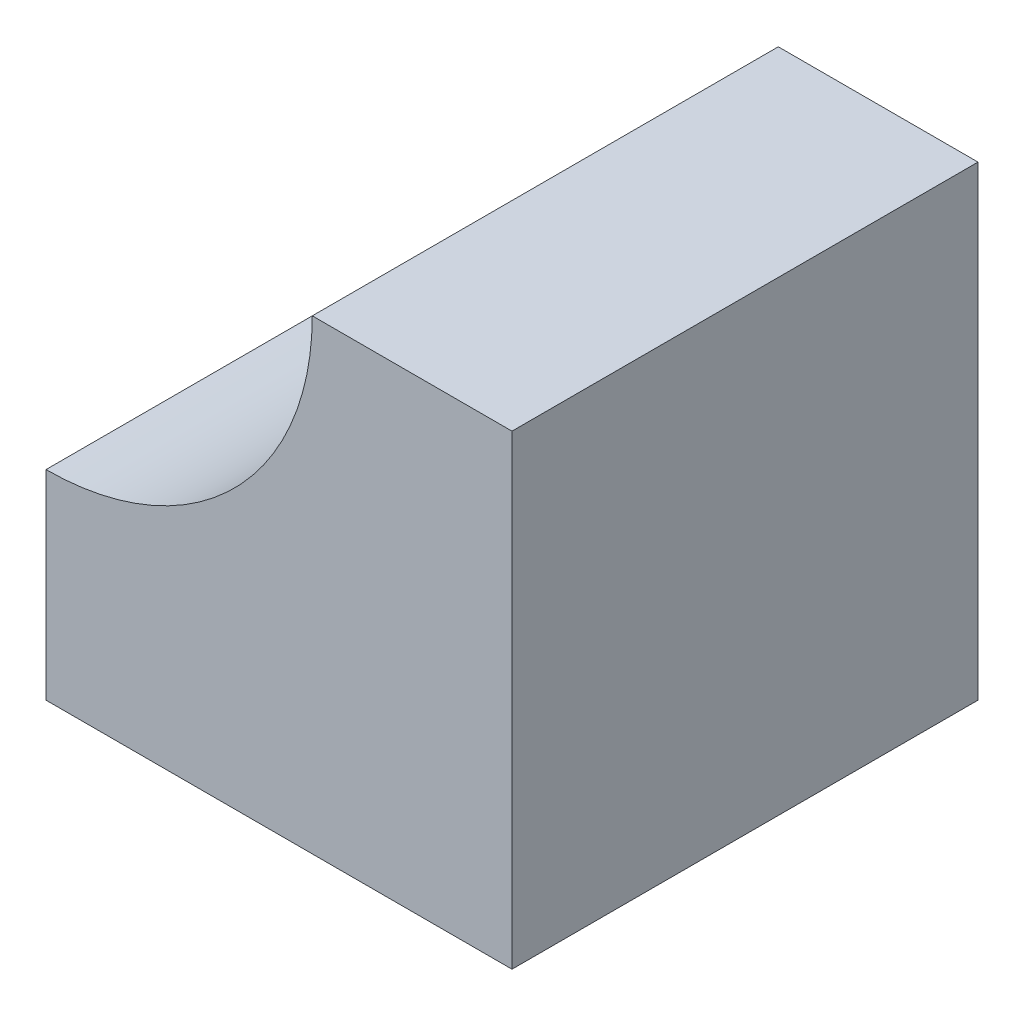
ISO-10303-21;
HEADER;
FILE_DESCRIPTION(('STEP AP214'),'2;1');
FILE_NAME('part.step','',(''),(''),'','','');
FILE_SCHEMA(('AUTOMOTIVE_DESIGN { 1 0 10303 214 1 1 1 1 }'));
ENDSEC;
DATA;
#1=APPLICATION_CONTEXT('core data for automotive mechanical design processes');
#2=APPLICATION_PROTOCOL_DEFINITION('international standard','automotive_design',2000,#1);
#3=PRODUCT_CONTEXT('',#1,'mechanical');
#4=PRODUCT('Part','Part','',(#3));
#5=PRODUCT_RELATED_PRODUCT_CATEGORY('part','',(#4));
#6=PRODUCT_DEFINITION_FORMATION('','',#4);
#7=PRODUCT_DEFINITION_CONTEXT('part definition',#1,'design');
#8=PRODUCT_DEFINITION('design','',#6,#7);
#9=PRODUCT_DEFINITION_SHAPE('','',#8);
#10=(LENGTH_UNIT() NAMED_UNIT(*) SI_UNIT(.MILLI.,.METRE.));
#11=(NAMED_UNIT(*) PLANE_ANGLE_UNIT() SI_UNIT($,.RADIAN.));
#12=(NAMED_UNIT(*) SI_UNIT($,.STERADIAN.) SOLID_ANGLE_UNIT());
#13=UNCERTAINTY_MEASURE_WITH_UNIT(LENGTH_MEASURE(1.E-05),#10,'distance_accuracy_value','');
#14=(GEOMETRIC_REPRESENTATION_CONTEXT(3) GLOBAL_UNCERTAINTY_ASSIGNED_CONTEXT((#13)) GLOBAL_UNIT_ASSIGNED_CONTEXT((#10,
#11,#12)) REPRESENTATION_CONTEXT('',''));
#15=CARTESIAN_POINT('',(0.,0.,0.));
#16=DIRECTION('',(0.,0.,1.));
#17=DIRECTION('',(1.,0.,0.));
#18=AXIS2_PLACEMENT_3D('',#15,#16,#17);
#19=CARTESIAN_POINT('',(-44.45,44.45,88.9));
#20=DIRECTION('',(0.,0.,-1.));
#21=DIRECTION('',(-1.,0.,0.));
#22=AXIS2_PLACEMENT_3D('',#19,#20,#21);
#23=CYLINDRICAL_SURFACE('',#22,50.8);
#24=CARTESIAN_POINT('',(-44.45,44.45,0.));
#25=DIRECTION('',(0.,0.,1.));
#26=DIRECTION('',(1.,0.,0.));
#27=AXIS2_PLACEMENT_3D('',#24,#25,#26);
#28=CIRCLE('',#27,50.8);
#29=CARTESIAN_POINT('',(-44.45,-6.35,0.));
#30=VERTEX_POINT('',#29);
#31=CARTESIAN_POINT('',(6.34999999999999,44.45,0.));
#32=VERTEX_POINT('',#31);
#33=EDGE_CURVE('E120',#30,#32,#28,.T.);
#34=ORIENTED_EDGE('',*,*,#33,.F.);
#35=DIRECTION('',(0.,0.,-1.));
#36=VECTOR('',#35,1.);
#37=CARTESIAN_POINT('',(-44.45,-6.35,88.9));
#38=LINE('',#37,#36);
#39=CARTESIAN_POINT('',(-44.45,-6.35,88.9));
#40=VERTEX_POINT('',#39);
#41=EDGE_CURVE('E11',#40,#30,#38,.T.);
#42=ORIENTED_EDGE('',*,*,#41,.F.);
#43=CARTESIAN_POINT('',(-44.45,44.45,88.9));
#44=DIRECTION('',(0.,0.,1.));
#45=DIRECTION('',(1.,0.,0.));
#46=AXIS2_PLACEMENT_3D('',#43,#44,#45);
#47=CIRCLE('',#46,50.8);
#48=CARTESIAN_POINT('',(6.34999999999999,44.45,88.9));
#49=VERTEX_POINT('',#48);
#50=EDGE_CURVE('E135',#40,#49,#47,.T.);
#51=ORIENTED_EDGE('',*,*,#50,.T.);
#52=DIRECTION('',(0.,0.,-1.));
#53=VECTOR('',#52,1.);
#54=CARTESIAN_POINT('',(6.34999999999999,44.45,88.9));
#55=LINE('',#54,#53);
#56=EDGE_CURVE('E58',#49,#32,#55,.T.);
#57=ORIENTED_EDGE('',*,*,#56,.T.);
#58=EDGE_LOOP('',(#34,#42,#51,#57));
#59=FACE_BOUND('',#58,.T.);
#60=ADVANCED_FACE('F41',(#59),#23,.F.);
#61=CARTESIAN_POINT('',(-44.45,0.,88.9));
#62=DIRECTION('',(1.,0.,0.));
#63=DIRECTION('',(0.,1.,0.));
#64=AXIS2_PLACEMENT_3D('',#61,#62,#63);
#65=PLANE('',#64);
#66=DIRECTION('',(0.,-1.,0.));
#67=VECTOR('',#66,1.);
#68=CARTESIAN_POINT('',(-44.45,0.,0.));
#69=LINE('',#68,#67);
#70=CARTESIAN_POINT('',(-44.45,-44.45,0.));
#71=VERTEX_POINT('',#70);
#72=EDGE_CURVE('E123',#30,#71,#69,.T.);
#73=ORIENTED_EDGE('',*,*,#72,.T.);
#74=DIRECTION('',(0.,0.,-1.));
#75=VECTOR('',#74,1.);
#76=CARTESIAN_POINT('',(-44.45,-44.45,88.9));
#77=LINE('',#76,#75);
#78=CARTESIAN_POINT('',(-44.45,-44.45,88.9));
#79=VERTEX_POINT('',#78);
#80=EDGE_CURVE('E50',#79,#71,#77,.T.);
#81=ORIENTED_EDGE('',*,*,#80,.F.);
#82=DIRECTION('',(0.,-1.,0.));
#83=VECTOR('',#82,1.);
#84=CARTESIAN_POINT('',(-44.45,0.,88.9));
#85=LINE('',#84,#83);
#86=EDGE_CURVE('E97',#40,#79,#85,.T.);
#87=ORIENTED_EDGE('',*,*,#86,.F.);
#88=ORIENTED_EDGE('',*,*,#41,.T.);
#89=EDGE_LOOP('',(#73,#81,#87,#88));
#90=FACE_BOUND('',#89,.T.);
#91=ADVANCED_FACE('F155',(#90),#65,.F.);
#92=CARTESIAN_POINT('',(0.,-44.45,88.9));
#93=DIRECTION('',(0.,1.,0.));
#94=DIRECTION('',(0.,0.,1.));
#95=AXIS2_PLACEMENT_3D('',#92,#93,#94);
#96=PLANE('',#95);
#97=DIRECTION('',(1.,0.,0.));
#98=VECTOR('',#97,1.);
#99=CARTESIAN_POINT('',(0.,-44.45,0.));
#100=LINE('',#99,#98);
#101=CARTESIAN_POINT('',(44.45,-44.45,0.));
#102=VERTEX_POINT('',#101);
#103=EDGE_CURVE('E107',#71,#102,#100,.T.);
#104=ORIENTED_EDGE('',*,*,#103,.T.);
#105=DIRECTION('',(0.,0.,-1.));
#106=VECTOR('',#105,1.);
#107=CARTESIAN_POINT('',(44.45,-44.45,88.9));
#108=LINE('',#107,#106);
#109=CARTESIAN_POINT('',(44.45,-44.45,88.9));
#110=VERTEX_POINT('',#109);
#111=EDGE_CURVE('E104',#110,#102,#108,.T.);
#112=ORIENTED_EDGE('',*,*,#111,.F.);
#113=DIRECTION('',(1.,0.,0.));
#114=VECTOR('',#113,1.);
#115=CARTESIAN_POINT('',(0.,-44.45,88.9));
#116=LINE('',#115,#114);
#117=EDGE_CURVE('E90',#79,#110,#116,.T.);
#118=ORIENTED_EDGE('',*,*,#117,.F.);
#119=ORIENTED_EDGE('',*,*,#80,.T.);
#120=EDGE_LOOP('',(#104,#112,#118,#119));
#121=FACE_BOUND('',#120,.T.);
#122=ADVANCED_FACE('F105',(#121),#96,.F.);
#123=CARTESIAN_POINT('',(44.45,0.,88.9));
#124=DIRECTION('',(1.,0.,0.));
#125=DIRECTION('',(0.,1.,0.));
#126=AXIS2_PLACEMENT_3D('',#123,#124,#125);
#127=PLANE('',#126);
#128=DIRECTION('',(0.,-1.,0.));
#129=VECTOR('',#128,1.);
#130=CARTESIAN_POINT('',(44.45,0.,0.));
#131=LINE('',#130,#129);
#132=CARTESIAN_POINT('',(44.45,44.45,0.));
#133=VERTEX_POINT('',#132);
#134=EDGE_CURVE('E128',#133,#102,#131,.T.);
#135=ORIENTED_EDGE('',*,*,#134,.F.);
#136=DIRECTION('',(0.,0.,-1.));
#137=VECTOR('',#136,1.);
#138=CARTESIAN_POINT('',(44.45,44.45,88.9));
#139=LINE('',#138,#137);
#140=CARTESIAN_POINT('',(44.45,44.45,88.9));
#141=VERTEX_POINT('',#140);
#142=EDGE_CURVE('E74',#141,#133,#139,.T.);
#143=ORIENTED_EDGE('',*,*,#142,.F.);
#144=DIRECTION('',(0.,-1.,0.));
#145=VECTOR('',#144,1.);
#146=CARTESIAN_POINT('',(44.45,0.,88.9));
#147=LINE('',#146,#145);
#148=EDGE_CURVE('E96',#141,#110,#147,.T.);
#149=ORIENTED_EDGE('',*,*,#148,.T.);
#150=ORIENTED_EDGE('',*,*,#111,.T.);
#151=EDGE_LOOP('',(#135,#143,#149,#150));
#152=FACE_BOUND('',#151,.T.);
#153=ADVANCED_FACE('F112',(#152),#127,.T.);
#154=CARTESIAN_POINT('',(0.,44.45,88.9));
#155=DIRECTION('',(0.,1.,0.));
#156=DIRECTION('',(0.,0.,1.));
#157=AXIS2_PLACEMENT_3D('',#154,#155,#156);
#158=PLANE('',#157);
#159=DIRECTION('',(1.,0.,0.));
#160=VECTOR('',#159,1.);
#161=CARTESIAN_POINT('',(0.,44.45,0.));
#162=LINE('',#161,#160);
#163=EDGE_CURVE('E131',#32,#133,#162,.T.);
#164=ORIENTED_EDGE('',*,*,#163,.F.);
#165=ORIENTED_EDGE('',*,*,#56,.F.);
#166=DIRECTION('',(1.,0.,0.));
#167=VECTOR('',#166,1.);
#168=CARTESIAN_POINT('',(0.,44.45,88.9));
#169=LINE('',#168,#167);
#170=EDGE_CURVE('E114',#49,#141,#169,.T.);
#171=ORIENTED_EDGE('',*,*,#170,.T.);
#172=ORIENTED_EDGE('',*,*,#142,.T.);
#173=EDGE_LOOP('',(#164,#165,#171,#172));
#174=FACE_BOUND('',#173,.T.);
#175=ADVANCED_FACE('F144',(#174),#158,.T.);
#176=CARTESIAN_POINT('',(0.,0.,88.9));
#177=DIRECTION('',(0.,0.,1.));
#178=DIRECTION('',(1.,0.,0.));
#179=AXIS2_PLACEMENT_3D('',#176,#177,#178);
#180=PLANE('',#179);
#181=ORIENTED_EDGE('',*,*,#50,.F.);
#182=ORIENTED_EDGE('',*,*,#86,.T.);
#183=ORIENTED_EDGE('',*,*,#117,.T.);
#184=ORIENTED_EDGE('',*,*,#148,.F.);
#185=ORIENTED_EDGE('',*,*,#170,.F.);
#186=EDGE_LOOP('',(#181,#182,#183,#184,#185));
#187=FACE_BOUND('',#186,.T.);
#188=ADVANCED_FACE('F93',(#187),#180,.T.);
#189=CARTESIAN_POINT('',(0.,0.,0.));
#190=DIRECTION('',(0.,0.,1.));
#191=DIRECTION('',(1.,0.,0.));
#192=AXIS2_PLACEMENT_3D('',#189,#190,#191);
#193=PLANE('',#192);
#194=ORIENTED_EDGE('',*,*,#33,.T.);
#195=ORIENTED_EDGE('',*,*,#163,.T.);
#196=ORIENTED_EDGE('',*,*,#134,.T.);
#197=ORIENTED_EDGE('',*,*,#103,.F.);
#198=ORIENTED_EDGE('',*,*,#72,.F.);
#199=EDGE_LOOP('',(#194,#195,#196,#197,#198));
#200=FACE_BOUND('',#199,.T.);
#201=ADVANCED_FACE('F143',(#200),#193,.F.);
#202=CLOSED_SHELL('',(#60,#91,#122,#153,#175,#188,#201));
#203=MANIFOLD_SOLID_BREP('B2',#202);
#204=ADVANCED_BREP_SHAPE_REPRESENTATION('',(#18,#203),#14);
#205=SHAPE_DEFINITION_REPRESENTATION(#9,#204);
ENDSEC;
END-ISO-10303-21;
